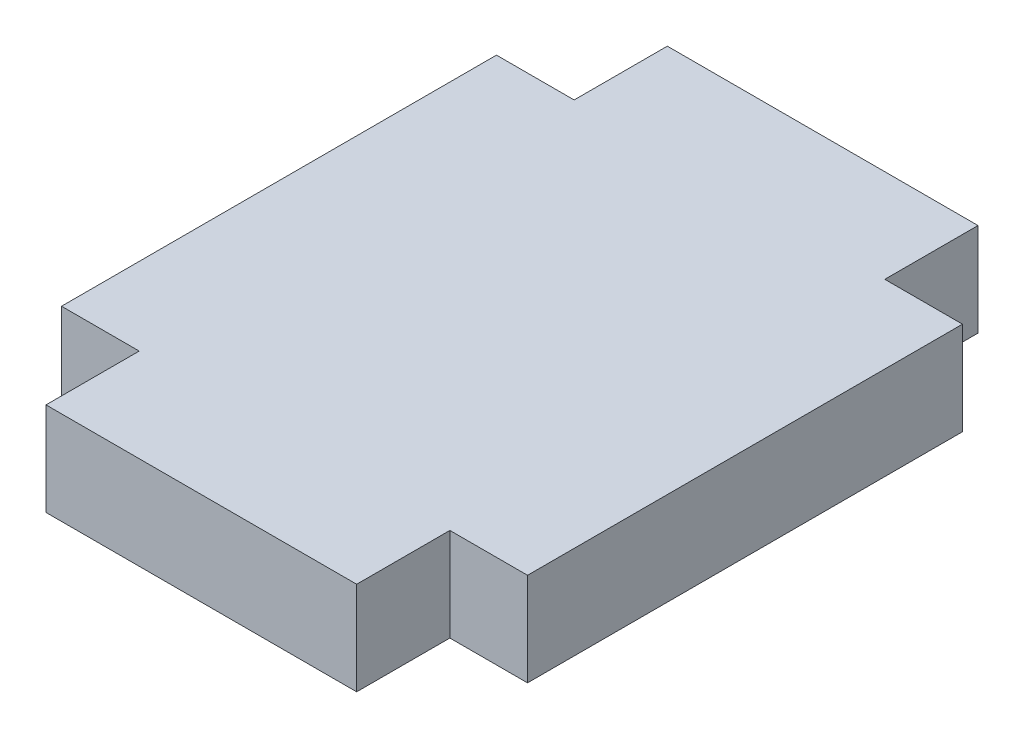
ISO-10303-21;
HEADER;
FILE_DESCRIPTION(('STEP AP214'),'2;1');
FILE_NAME('part.step','',(''),(''),'','','');
FILE_SCHEMA(('AUTOMOTIVE_DESIGN { 1 0 10303 214 1 1 1 1 }'));
ENDSEC;
DATA;
#1=APPLICATION_CONTEXT('core data for automotive mechanical design processes');
#2=APPLICATION_PROTOCOL_DEFINITION('international standard','automotive_design',2000,#1);
#3=PRODUCT_CONTEXT('',#1,'mechanical');
#4=PRODUCT('Part','Part','',(#3));
#5=PRODUCT_RELATED_PRODUCT_CATEGORY('part','',(#4));
#6=PRODUCT_DEFINITION_FORMATION('','',#4);
#7=PRODUCT_DEFINITION_CONTEXT('part definition',#1,'design');
#8=PRODUCT_DEFINITION('design','',#6,#7);
#9=PRODUCT_DEFINITION_SHAPE('','',#8);
#10=(LENGTH_UNIT() NAMED_UNIT(*) SI_UNIT(.MILLI.,.METRE.));
#11=(NAMED_UNIT(*) PLANE_ANGLE_UNIT() SI_UNIT($,.RADIAN.));
#12=(NAMED_UNIT(*) SI_UNIT($,.STERADIAN.) SOLID_ANGLE_UNIT());
#13=UNCERTAINTY_MEASURE_WITH_UNIT(LENGTH_MEASURE(1.E-05),#10,'distance_accuracy_value','');
#14=(GEOMETRIC_REPRESENTATION_CONTEXT(3) GLOBAL_UNCERTAINTY_ASSIGNED_CONTEXT((#13)) GLOBAL_UNIT_ASSIGNED_CONTEXT((#10,
#11,#12)) REPRESENTATION_CONTEXT('',''));
#15=CARTESIAN_POINT('',(0.,0.,0.));
#16=DIRECTION('',(0.,0.,1.));
#17=DIRECTION('',(1.,0.,0.));
#18=AXIS2_PLACEMENT_3D('',#15,#16,#17);
#19=CARTESIAN_POINT('',(10.,6.,14.));
#20=DIRECTION('',(0.,0.,-1.));
#21=DIRECTION('',(-1.,0.,0.));
#22=AXIS2_PLACEMENT_3D('',#19,#20,#21);
#23=PLANE('',#22);
#24=DIRECTION('',(1.,0.,0.));
#25=VECTOR('',#24,1.);
#26=CARTESIAN_POINT('',(10.,0.,14.));
#27=LINE('',#26,#25);
#28=CARTESIAN_POINT('',(10.,0.,14.));
#29=VERTEX_POINT('',#28);
#30=CARTESIAN_POINT('',(15.,0.,14.));
#31=VERTEX_POINT('',#30);
#32=EDGE_CURVE('E170',#29,#31,#27,.T.);
#33=ORIENTED_EDGE('',*,*,#32,.T.);
#34=DIRECTION('',(0.,-1.,0.));
#35=VECTOR('',#34,1.);
#36=CARTESIAN_POINT('',(15.,6.,14.));
#37=LINE('',#36,#35);
#38=CARTESIAN_POINT('',(15.,6.,14.));
#39=VERTEX_POINT('',#38);
#40=EDGE_CURVE('E11',#39,#31,#37,.T.);
#41=ORIENTED_EDGE('',*,*,#40,.F.);
#42=DIRECTION('',(1.,0.,0.));
#43=VECTOR('',#42,1.);
#44=CARTESIAN_POINT('',(10.,6.,14.));
#45=LINE('',#44,#43);
#46=CARTESIAN_POINT('',(10.,6.,14.));
#47=VERTEX_POINT('',#46);
#48=EDGE_CURVE('E204',#47,#39,#45,.T.);
#49=ORIENTED_EDGE('',*,*,#48,.F.);
#50=DIRECTION('',(0.,-1.,0.));
#51=VECTOR('',#50,1.);
#52=CARTESIAN_POINT('',(10.,6.,14.));
#53=LINE('',#52,#51);
#54=EDGE_CURVE('E166',#47,#29,#53,.T.);
#55=ORIENTED_EDGE('',*,*,#54,.T.);
#56=EDGE_LOOP('',(#33,#41,#49,#55));
#57=FACE_BOUND('',#56,.T.);
#58=ADVANCED_FACE('F45',(#57),#23,.F.);
#59=CARTESIAN_POINT('',(15.,6.,-14.));
#60=DIRECTION('',(-1.,0.,0.));
#61=DIRECTION('',(0.,0.,1.));
#62=AXIS2_PLACEMENT_3D('',#59,#60,#61);
#63=PLANE('',#62);
#64=DIRECTION('',(0.,0.,-1.));
#65=VECTOR('',#64,1.);
#66=CARTESIAN_POINT('',(15.,0.,-14.));
#67=LINE('',#66,#65);
#68=CARTESIAN_POINT('',(15.,0.,-14.));
#69=VERTEX_POINT('',#68);
#70=EDGE_CURVE('E174',#31,#69,#67,.T.);
#71=ORIENTED_EDGE('',*,*,#70,.T.);
#72=DIRECTION('',(0.,-1.,0.));
#73=VECTOR('',#72,1.);
#74=CARTESIAN_POINT('',(15.,6.,-14.));
#75=LINE('',#74,#73);
#76=CARTESIAN_POINT('',(15.,6.,-14.));
#77=VERTEX_POINT('',#76);
#78=EDGE_CURVE('E54',#77,#69,#75,.T.);
#79=ORIENTED_EDGE('',*,*,#78,.F.);
#80=DIRECTION('',(0.,0.,-1.));
#81=VECTOR('',#80,1.);
#82=CARTESIAN_POINT('',(15.,6.,-14.));
#83=LINE('',#82,#81);
#84=EDGE_CURVE('E117',#39,#77,#83,.T.);
#85=ORIENTED_EDGE('',*,*,#84,.F.);
#86=ORIENTED_EDGE('',*,*,#40,.T.);
#87=EDGE_LOOP('',(#71,#79,#85,#86));
#88=FACE_BOUND('',#87,.T.);
#89=ADVANCED_FACE('F298',(#88),#63,.F.);
#90=CARTESIAN_POINT('',(10.,6.,-14.));
#91=DIRECTION('',(0.,0.,1.));
#92=DIRECTION('',(1.,0.,0.));
#93=AXIS2_PLACEMENT_3D('',#90,#91,#92);
#94=PLANE('',#93);
#95=DIRECTION('',(-1.,0.,0.));
#96=VECTOR('',#95,1.);
#97=CARTESIAN_POINT('',(10.,0.,-14.));
#98=LINE('',#97,#96);
#99=CARTESIAN_POINT('',(10.,0.,-14.));
#100=VERTEX_POINT('',#99);
#101=EDGE_CURVE('E177',#69,#100,#98,.T.);
#102=ORIENTED_EDGE('',*,*,#101,.T.);
#103=DIRECTION('',(0.,-1.,0.));
#104=VECTOR('',#103,1.);
#105=CARTESIAN_POINT('',(10.,6.,-14.));
#106=LINE('',#105,#104);
#107=CARTESIAN_POINT('',(10.,6.,-14.));
#108=VERTEX_POINT('',#107);
#109=EDGE_CURVE('E231',#108,#100,#106,.T.);
#110=ORIENTED_EDGE('',*,*,#109,.F.);
#111=DIRECTION('',(-1.,0.,0.));
#112=VECTOR('',#111,1.);
#113=CARTESIAN_POINT('',(10.,6.,-14.));
#114=LINE('',#113,#112);
#115=EDGE_CURVE('E241',#77,#108,#114,.T.);
#116=ORIENTED_EDGE('',*,*,#115,.F.);
#117=ORIENTED_EDGE('',*,*,#78,.T.);
#118=EDGE_LOOP('',(#102,#110,#116,#117));
#119=FACE_BOUND('',#118,.T.);
#120=ADVANCED_FACE('F239',(#119),#94,.F.);
#121=CARTESIAN_POINT('',(10.,6.,-20.));
#122=DIRECTION('',(-1.,0.,0.));
#123=DIRECTION('',(0.,0.,1.));
#124=AXIS2_PLACEMENT_3D('',#121,#122,#123);
#125=PLANE('',#124);
#126=DIRECTION('',(0.,0.,-1.));
#127=VECTOR('',#126,1.);
#128=CARTESIAN_POINT('',(10.,0.,-20.));
#129=LINE('',#128,#127);
#130=CARTESIAN_POINT('',(10.,0.,-20.));
#131=VERTEX_POINT('',#130);
#132=EDGE_CURVE('E180',#100,#131,#129,.T.);
#133=ORIENTED_EDGE('',*,*,#132,.T.);
#134=DIRECTION('',(0.,-1.,0.));
#135=VECTOR('',#134,1.);
#136=CARTESIAN_POINT('',(10.,6.,-20.));
#137=LINE('',#136,#135);
#138=CARTESIAN_POINT('',(10.,6.,-20.));
#139=VERTEX_POINT('',#138);
#140=EDGE_CURVE('E227',#139,#131,#137,.T.);
#141=ORIENTED_EDGE('',*,*,#140,.F.);
#142=DIRECTION('',(0.,0.,-1.));
#143=VECTOR('',#142,1.);
#144=CARTESIAN_POINT('',(10.,6.,-20.));
#145=LINE('',#144,#143);
#146=EDGE_CURVE('E260',#108,#139,#145,.T.);
#147=ORIENTED_EDGE('',*,*,#146,.F.);
#148=ORIENTED_EDGE('',*,*,#109,.T.);
#149=EDGE_LOOP('',(#133,#141,#147,#148));
#150=FACE_BOUND('',#149,.T.);
#151=ADVANCED_FACE('F250',(#150),#125,.F.);
#152=CARTESIAN_POINT('',(-10.,6.,-20.));
#153=DIRECTION('',(0.,0.,1.));
#154=DIRECTION('',(1.,0.,0.));
#155=AXIS2_PLACEMENT_3D('',#152,#153,#154);
#156=PLANE('',#155);
#157=DIRECTION('',(-1.,0.,0.));
#158=VECTOR('',#157,1.);
#159=CARTESIAN_POINT('',(-10.,0.,-20.));
#160=LINE('',#159,#158);
#161=CARTESIAN_POINT('',(-10.,0.,-20.));
#162=VERTEX_POINT('',#161);
#163=EDGE_CURVE('E183',#131,#162,#160,.T.);
#164=ORIENTED_EDGE('',*,*,#163,.T.);
#165=DIRECTION('',(0.,-1.,0.));
#166=VECTOR('',#165,1.);
#167=CARTESIAN_POINT('',(-10.,6.,-20.));
#168=LINE('',#167,#166);
#169=CARTESIAN_POINT('',(-10.,6.,-20.));
#170=VERTEX_POINT('',#169);
#171=EDGE_CURVE('E223',#170,#162,#168,.T.);
#172=ORIENTED_EDGE('',*,*,#171,.F.);
#173=DIRECTION('',(-1.,0.,0.));
#174=VECTOR('',#173,1.);
#175=CARTESIAN_POINT('',(-10.,6.,-20.));
#176=LINE('',#175,#174);
#177=EDGE_CURVE('E256',#139,#170,#176,.T.);
#178=ORIENTED_EDGE('',*,*,#177,.F.);
#179=ORIENTED_EDGE('',*,*,#140,.T.);
#180=EDGE_LOOP('',(#164,#172,#178,#179));
#181=FACE_BOUND('',#180,.T.);
#182=ADVANCED_FACE('F254',(#181),#156,.F.);
#183=CARTESIAN_POINT('',(-10.,6.,-14.));
#184=DIRECTION('',(1.,0.,0.));
#185=DIRECTION('',(0.,0.,-1.));
#186=AXIS2_PLACEMENT_3D('',#183,#184,#185);
#187=PLANE('',#186);
#188=DIRECTION('',(0.,0.,1.));
#189=VECTOR('',#188,1.);
#190=CARTESIAN_POINT('',(-10.,0.,-14.));
#191=LINE('',#190,#189);
#192=CARTESIAN_POINT('',(-10.,0.,-14.));
#193=VERTEX_POINT('',#192);
#194=EDGE_CURVE('E186',#162,#193,#191,.T.);
#195=ORIENTED_EDGE('',*,*,#194,.T.);
#196=DIRECTION('',(0.,-1.,0.));
#197=VECTOR('',#196,1.);
#198=CARTESIAN_POINT('',(-10.,6.,-14.));
#199=LINE('',#198,#197);
#200=CARTESIAN_POINT('',(-10.,6.,-14.));
#201=VERTEX_POINT('',#200);
#202=EDGE_CURVE('E219',#201,#193,#199,.T.);
#203=ORIENTED_EDGE('',*,*,#202,.F.);
#204=DIRECTION('',(0.,0.,1.));
#205=VECTOR('',#204,1.);
#206=CARTESIAN_POINT('',(-10.,6.,-14.));
#207=LINE('',#206,#205);
#208=EDGE_CURVE('E259',#170,#201,#207,.T.);
#209=ORIENTED_EDGE('',*,*,#208,.F.);
#210=ORIENTED_EDGE('',*,*,#171,.T.);
#211=EDGE_LOOP('',(#195,#203,#209,#210));
#212=FACE_BOUND('',#211,.T.);
#213=ADVANCED_FACE('F311',(#212),#187,.F.);
#214=CARTESIAN_POINT('',(-10.,6.,-14.));
#215=DIRECTION('',(0.,0.,1.));
#216=DIRECTION('',(1.,0.,0.));
#217=AXIS2_PLACEMENT_3D('',#214,#215,#216);
#218=PLANE('',#217);
#219=DIRECTION('',(-1.,0.,0.));
#220=VECTOR('',#219,1.);
#221=CARTESIAN_POINT('',(-10.,0.,-14.));
#222=LINE('',#221,#220);
#223=CARTESIAN_POINT('',(-15.,0.,-14.));
#224=VERTEX_POINT('',#223);
#225=EDGE_CURVE('E189',#193,#224,#222,.T.);
#226=ORIENTED_EDGE('',*,*,#225,.T.);
#227=DIRECTION('',(0.,-1.,0.));
#228=VECTOR('',#227,1.);
#229=CARTESIAN_POINT('',(-15.,6.,-14.));
#230=LINE('',#229,#228);
#231=CARTESIAN_POINT('',(-15.,6.,-14.));
#232=VERTEX_POINT('',#231);
#233=EDGE_CURVE('E215',#232,#224,#230,.T.);
#234=ORIENTED_EDGE('',*,*,#233,.F.);
#235=DIRECTION('',(-1.,0.,0.));
#236=VECTOR('',#235,1.);
#237=CARTESIAN_POINT('',(-10.,6.,-14.));
#238=LINE('',#237,#236);
#239=EDGE_CURVE('E264',#201,#232,#238,.T.);
#240=ORIENTED_EDGE('',*,*,#239,.F.);
#241=ORIENTED_EDGE('',*,*,#202,.T.);
#242=EDGE_LOOP('',(#226,#234,#240,#241));
#243=FACE_BOUND('',#242,.T.);
#244=ADVANCED_FACE('F314',(#243),#218,.F.);
#245=CARTESIAN_POINT('',(-15.,6.,-14.));
#246=DIRECTION('',(1.,0.,0.));
#247=DIRECTION('',(0.,0.,-1.));
#248=AXIS2_PLACEMENT_3D('',#245,#246,#247);
#249=PLANE('',#248);
#250=DIRECTION('',(0.,0.,1.));
#251=VECTOR('',#250,1.);
#252=CARTESIAN_POINT('',(-15.,0.,-14.));
#253=LINE('',#252,#251);
#254=CARTESIAN_POINT('',(-15.,0.,14.));
#255=VERTEX_POINT('',#254);
#256=EDGE_CURVE('E192',#224,#255,#253,.T.);
#257=ORIENTED_EDGE('',*,*,#256,.T.);
#258=DIRECTION('',(0.,-1.,0.));
#259=VECTOR('',#258,1.);
#260=CARTESIAN_POINT('',(-15.,6.,14.));
#261=LINE('',#260,#259);
#262=CARTESIAN_POINT('',(-15.,6.,14.));
#263=VERTEX_POINT('',#262);
#264=EDGE_CURVE('E211',#263,#255,#261,.T.);
#265=ORIENTED_EDGE('',*,*,#264,.F.);
#266=DIRECTION('',(0.,0.,1.));
#267=VECTOR('',#266,1.);
#268=CARTESIAN_POINT('',(-15.,6.,-14.));
#269=LINE('',#268,#267);
#270=EDGE_CURVE('E271',#232,#263,#269,.T.);
#271=ORIENTED_EDGE('',*,*,#270,.F.);
#272=ORIENTED_EDGE('',*,*,#233,.T.);
#273=EDGE_LOOP('',(#257,#265,#271,#272));
#274=FACE_BOUND('',#273,.T.);
#275=ADVANCED_FACE('F279',(#274),#249,.F.);
#276=CARTESIAN_POINT('',(-15.,6.,14.));
#277=DIRECTION('',(0.,0.,-1.));
#278=DIRECTION('',(-1.,0.,0.));
#279=AXIS2_PLACEMENT_3D('',#276,#277,#278);
#280=PLANE('',#279);
#281=DIRECTION('',(1.,0.,0.));
#282=VECTOR('',#281,1.);
#283=CARTESIAN_POINT('',(-15.,0.,14.));
#284=LINE('',#283,#282);
#285=CARTESIAN_POINT('',(-10.,0.,14.));
#286=VERTEX_POINT('',#285);
#287=EDGE_CURVE('E195',#255,#286,#284,.T.);
#288=ORIENTED_EDGE('',*,*,#287,.T.);
#289=DIRECTION('',(0.,-1.,0.));
#290=VECTOR('',#289,1.);
#291=CARTESIAN_POINT('',(-10.,6.,14.));
#292=LINE('',#291,#290);
#293=CARTESIAN_POINT('',(-10.,6.,14.));
#294=VERTEX_POINT('',#293);
#295=EDGE_CURVE('E159',#294,#286,#292,.T.);
#296=ORIENTED_EDGE('',*,*,#295,.F.);
#297=DIRECTION('',(1.,0.,0.));
#298=VECTOR('',#297,1.);
#299=CARTESIAN_POINT('',(-15.,6.,14.));
#300=LINE('',#299,#298);
#301=EDGE_CURVE('E148',#263,#294,#300,.T.);
#302=ORIENTED_EDGE('',*,*,#301,.F.);
#303=ORIENTED_EDGE('',*,*,#264,.T.);
#304=EDGE_LOOP('',(#288,#296,#302,#303));
#305=FACE_BOUND('',#304,.T.);
#306=ADVANCED_FACE('F283',(#305),#280,.F.);
#307=CARTESIAN_POINT('',(-10.,6.,14.));
#308=DIRECTION('',(1.,0.,0.));
#309=DIRECTION('',(0.,0.,-1.));
#310=AXIS2_PLACEMENT_3D('',#307,#308,#309);
#311=PLANE('',#310);
#312=DIRECTION('',(0.,0.,1.));
#313=VECTOR('',#312,1.);
#314=CARTESIAN_POINT('',(-10.,0.,14.));
#315=LINE('',#314,#313);
#316=CARTESIAN_POINT('',(-10.,0.,20.));
#317=VERTEX_POINT('',#316);
#318=EDGE_CURVE('E157',#286,#317,#315,.T.);
#319=ORIENTED_EDGE('',*,*,#318,.T.);
#320=DIRECTION('',(0.,-1.,0.));
#321=VECTOR('',#320,1.);
#322=CARTESIAN_POINT('',(-10.,6.,20.));
#323=LINE('',#322,#321);
#324=CARTESIAN_POINT('',(-10.,6.,20.));
#325=VERTEX_POINT('',#324);
#326=EDGE_CURVE('E154',#325,#317,#323,.T.);
#327=ORIENTED_EDGE('',*,*,#326,.F.);
#328=DIRECTION('',(0.,0.,1.));
#329=VECTOR('',#328,1.);
#330=CARTESIAN_POINT('',(-10.,6.,14.));
#331=LINE('',#330,#329);
#332=EDGE_CURVE('E142',#294,#325,#331,.T.);
#333=ORIENTED_EDGE('',*,*,#332,.F.);
#334=ORIENTED_EDGE('',*,*,#295,.T.);
#335=EDGE_LOOP('',(#319,#327,#333,#334));
#336=FACE_BOUND('',#335,.T.);
#337=ADVANCED_FACE('F155',(#336),#311,.F.);
#338=CARTESIAN_POINT('',(-10.,6.,20.));
#339=DIRECTION('',(0.,0.,-1.));
#340=DIRECTION('',(-1.,0.,0.));
#341=AXIS2_PLACEMENT_3D('',#338,#339,#340);
#342=PLANE('',#341);
#343=DIRECTION('',(1.,0.,0.));
#344=VECTOR('',#343,1.);
#345=CARTESIAN_POINT('',(-10.,0.,20.));
#346=LINE('',#345,#344);
#347=CARTESIAN_POINT('',(10.,0.,20.));
#348=VERTEX_POINT('',#347);
#349=EDGE_CURVE('E103',#317,#348,#346,.T.);
#350=ORIENTED_EDGE('',*,*,#349,.T.);
#351=DIRECTION('',(0.,-1.,0.));
#352=VECTOR('',#351,1.);
#353=CARTESIAN_POINT('',(10.,6.,20.));
#354=LINE('',#353,#352);
#355=CARTESIAN_POINT('',(10.,6.,20.));
#356=VERTEX_POINT('',#355);
#357=EDGE_CURVE('E160',#356,#348,#354,.T.);
#358=ORIENTED_EDGE('',*,*,#357,.F.);
#359=DIRECTION('',(1.,0.,0.));
#360=VECTOR('',#359,1.);
#361=CARTESIAN_POINT('',(-10.,6.,20.));
#362=LINE('',#361,#360);
#363=EDGE_CURVE('E146',#325,#356,#362,.T.);
#364=ORIENTED_EDGE('',*,*,#363,.F.);
#365=ORIENTED_EDGE('',*,*,#326,.T.);
#366=EDGE_LOOP('',(#350,#358,#364,#365));
#367=FACE_BOUND('',#366,.T.);
#368=ADVANCED_FACE('F162',(#367),#342,.F.);
#369=CARTESIAN_POINT('',(10.,6.,20.));
#370=DIRECTION('',(-1.,0.,0.));
#371=DIRECTION('',(0.,0.,1.));
#372=AXIS2_PLACEMENT_3D('',#369,#370,#371);
#373=PLANE('',#372);
#374=DIRECTION('',(0.,0.,-1.));
#375=VECTOR('',#374,1.);
#376=CARTESIAN_POINT('',(10.,0.,20.));
#377=LINE('',#376,#375);
#378=EDGE_CURVE('E109',#348,#29,#377,.T.);
#379=ORIENTED_EDGE('',*,*,#378,.T.);
#380=ORIENTED_EDGE('',*,*,#54,.F.);
#381=DIRECTION('',(0.,0.,-1.));
#382=VECTOR('',#381,1.);
#383=CARTESIAN_POINT('',(10.,6.,20.));
#384=LINE('',#383,#382);
#385=EDGE_CURVE('E62',#356,#47,#384,.T.);
#386=ORIENTED_EDGE('',*,*,#385,.F.);
#387=ORIENTED_EDGE('',*,*,#357,.T.);
#388=EDGE_LOOP('',(#379,#380,#386,#387));
#389=FACE_BOUND('',#388,.T.);
#390=ADVANCED_FACE('F287',(#389),#373,.F.);
#391=CARTESIAN_POINT('',(0.,6.,0.));
#392=DIRECTION('',(0.,-1.,0.));
#393=DIRECTION('',(0.,0.,-1.));
#394=AXIS2_PLACEMENT_3D('',#391,#392,#393);
#395=PLANE('',#394);
#396=ORIENTED_EDGE('',*,*,#48,.T.);
#397=ORIENTED_EDGE('',*,*,#84,.T.);
#398=ORIENTED_EDGE('',*,*,#115,.T.);
#399=ORIENTED_EDGE('',*,*,#146,.T.);
#400=ORIENTED_EDGE('',*,*,#177,.T.);
#401=ORIENTED_EDGE('',*,*,#208,.T.);
#402=ORIENTED_EDGE('',*,*,#239,.T.);
#403=ORIENTED_EDGE('',*,*,#270,.T.);
#404=ORIENTED_EDGE('',*,*,#301,.T.);
#405=ORIENTED_EDGE('',*,*,#332,.T.);
#406=ORIENTED_EDGE('',*,*,#363,.T.);
#407=ORIENTED_EDGE('',*,*,#385,.T.);
#408=EDGE_LOOP('',(#396,#397,#398,#399,#400,#401,#402,#403,#404,#405,#406,#407));
#409=FACE_BOUND('',#408,.T.);
#410=ADVANCED_FACE('F144',(#409),#395,.F.);
#411=CARTESIAN_POINT('',(0.,0.,0.));
#412=DIRECTION('',(0.,-1.,0.));
#413=DIRECTION('',(0.,0.,-1.));
#414=AXIS2_PLACEMENT_3D('',#411,#412,#413);
#415=PLANE('',#414);
#416=ORIENTED_EDGE('',*,*,#32,.F.);
#417=ORIENTED_EDGE('',*,*,#378,.F.);
#418=ORIENTED_EDGE('',*,*,#349,.F.);
#419=ORIENTED_EDGE('',*,*,#318,.F.);
#420=ORIENTED_EDGE('',*,*,#287,.F.);
#421=ORIENTED_EDGE('',*,*,#256,.F.);
#422=ORIENTED_EDGE('',*,*,#225,.F.);
#423=ORIENTED_EDGE('',*,*,#194,.F.);
#424=ORIENTED_EDGE('',*,*,#163,.F.);
#425=ORIENTED_EDGE('',*,*,#132,.F.);
#426=ORIENTED_EDGE('',*,*,#101,.F.);
#427=ORIENTED_EDGE('',*,*,#70,.F.);
#428=EDGE_LOOP('',(#416,#417,#418,#419,#420,#421,#422,#423,#424,#425,#426,#427));
#429=FACE_BOUND('',#428,.T.);
#430=ADVANCED_FACE('F245',(#429),#415,.T.);
#431=CLOSED_SHELL('',(#58,#89,#120,#151,#182,#213,#244,#275,#306,#337,#368,#390,#410,#430));
#432=MANIFOLD_SOLID_BREP('B2',#431);
#433=ADVANCED_BREP_SHAPE_REPRESENTATION('',(#18,#432),#14);
#434=SHAPE_DEFINITION_REPRESENTATION(#9,#433);
ENDSEC;
END-ISO-10303-21;
